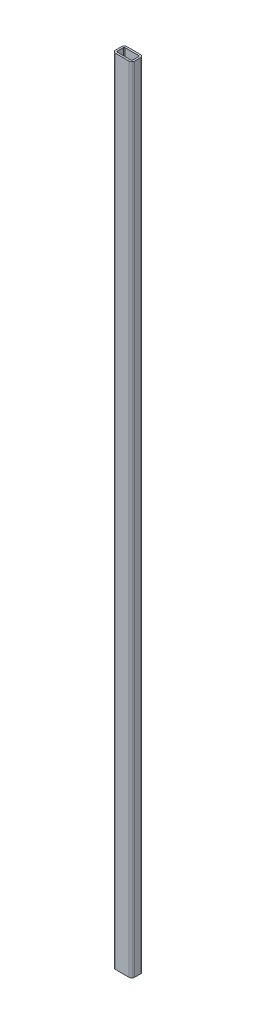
ISO-10303-21;
HEADER;
FILE_DESCRIPTION(('STEP AP214'),'2;1');
FILE_NAME('part.step','',(''),(''),'','','');
FILE_SCHEMA(('AUTOMOTIVE_DESIGN { 1 0 10303 214 1 1 1 1 }'));
ENDSEC;
DATA;
#1=APPLICATION_CONTEXT('core data for automotive mechanical design processes');
#2=APPLICATION_PROTOCOL_DEFINITION('international standard','automotive_design',2000,#1);
#3=PRODUCT_CONTEXT('',#1,'mechanical');
#4=PRODUCT('Part','Part','',(#3));
#5=PRODUCT_RELATED_PRODUCT_CATEGORY('part','',(#4));
#6=PRODUCT_DEFINITION_FORMATION('','',#4);
#7=PRODUCT_DEFINITION_CONTEXT('part definition',#1,'design');
#8=PRODUCT_DEFINITION('design','',#6,#7);
#9=PRODUCT_DEFINITION_SHAPE('','',#8);
#10=(LENGTH_UNIT() NAMED_UNIT(*) SI_UNIT(.MILLI.,.METRE.));
#11=(NAMED_UNIT(*) PLANE_ANGLE_UNIT() SI_UNIT($,.RADIAN.));
#12=(NAMED_UNIT(*) SI_UNIT($,.STERADIAN.) SOLID_ANGLE_UNIT());
#13=UNCERTAINTY_MEASURE_WITH_UNIT(LENGTH_MEASURE(1.E-05),#10,'distance_accuracy_value','');
#14=(GEOMETRIC_REPRESENTATION_CONTEXT(3) GLOBAL_UNCERTAINTY_ASSIGNED_CONTEXT((#13)) GLOBAL_UNIT_ASSIGNED_CONTEXT((#10,
#11,#12)) REPRESENTATION_CONTEXT('',''));
#15=CARTESIAN_POINT('',(0.,0.,0.));
#16=DIRECTION('',(0.,0.,1.));
#17=DIRECTION('',(1.,0.,0.));
#18=AXIS2_PLACEMENT_3D('',#15,#16,#17);
#19=CARTESIAN_POINT('',(0.,1320.8,0.));
#20=DIRECTION('',(0.,-1.,0.));
#21=DIRECTION('',(0.,0.,-1.));
#22=AXIS2_PLACEMENT_3D('',#19,#20,#21);
#23=PLANE('',#22);
#24=DIRECTION('',(-1.,0.,0.));
#25=VECTOR('',#24,1.);
#26=CARTESIAN_POINT('',(-15.875,1320.8,-9.525));
#27=LINE('',#26,#25);
#28=CARTESIAN_POINT('',(11.303,1320.8,-9.525));
#29=VERTEX_POINT('',#28);
#30=CARTESIAN_POINT('',(-11.303,1320.8,-9.525));
#31=VERTEX_POINT('',#30);
#32=EDGE_CURVE('E236',#29,#31,#27,.T.);
#33=ORIENTED_EDGE('',*,*,#32,.T.);
#34=CARTESIAN_POINT('',(-11.303,1320.8,-4.953));
#35=DIRECTION('',(0.,-1.,0.));
#36=DIRECTION('',(0.,0.,-1.));
#37=AXIS2_PLACEMENT_3D('',#34,#35,#36);
#38=CIRCLE('',#37,4.572);
#39=CARTESIAN_POINT('',(-15.875,1320.8,-4.953));
#40=VERTEX_POINT('',#39);
#41=EDGE_CURVE('E291',#31,#40,#38,.F.);
#42=ORIENTED_EDGE('',*,*,#41,.T.);
#43=DIRECTION('',(0.,0.,1.));
#44=VECTOR('',#43,1.);
#45=CARTESIAN_POINT('',(-15.875,1320.8,9.525));
#46=LINE('',#45,#44);
#47=CARTESIAN_POINT('',(-15.875,1320.8,4.953));
#48=VERTEX_POINT('',#47);
#49=EDGE_CURVE('E241',#40,#48,#46,.T.);
#50=ORIENTED_EDGE('',*,*,#49,.T.);
#51=CARTESIAN_POINT('',(-11.303,1320.8,4.953));
#52=DIRECTION('',(0.,-1.,0.));
#53=DIRECTION('',(0.,0.,-1.));
#54=AXIS2_PLACEMENT_3D('',#51,#52,#53);
#55=CIRCLE('',#54,4.572);
#56=CARTESIAN_POINT('',(-11.303,1320.8,9.525));
#57=VERTEX_POINT('',#56);
#58=EDGE_CURVE('E282',#48,#57,#55,.F.);
#59=ORIENTED_EDGE('',*,*,#58,.T.);
#60=DIRECTION('',(1.,0.,0.));
#61=VECTOR('',#60,1.);
#62=CARTESIAN_POINT('',(-15.875,1320.8,9.525));
#63=LINE('',#62,#61);
#64=CARTESIAN_POINT('',(11.303,1320.8,9.525));
#65=VERTEX_POINT('',#64);
#66=EDGE_CURVE('E245',#57,#65,#63,.T.);
#67=ORIENTED_EDGE('',*,*,#66,.T.);
#68=CARTESIAN_POINT('',(11.303,1320.8,4.953));
#69=DIRECTION('',(0.,-1.,0.));
#70=DIRECTION('',(0.,0.,-1.));
#71=AXIS2_PLACEMENT_3D('',#68,#69,#70);
#72=CIRCLE('',#71,4.572);
#73=CARTESIAN_POINT('',(15.875,1320.8,4.953));
#74=VERTEX_POINT('',#73);
#75=EDGE_CURVE('E285',#65,#74,#72,.F.);
#76=ORIENTED_EDGE('',*,*,#75,.T.);
#77=DIRECTION('',(0.,0.,-1.));
#78=VECTOR('',#77,1.);
#79=CARTESIAN_POINT('',(15.875,1320.8,9.525));
#80=LINE('',#79,#78);
#81=CARTESIAN_POINT('',(15.875,1320.8,-4.953));
#82=VERTEX_POINT('',#81);
#83=EDGE_CURVE('E232',#74,#82,#80,.T.);
#84=ORIENTED_EDGE('',*,*,#83,.T.);
#85=CARTESIAN_POINT('',(11.303,1320.8,-4.953));
#86=DIRECTION('',(0.,-1.,0.));
#87=DIRECTION('',(0.,0.,-1.));
#88=AXIS2_PLACEMENT_3D('',#85,#86,#87);
#89=CIRCLE('',#88,4.572);
#90=EDGE_CURVE('E288',#82,#29,#89,.F.);
#91=ORIENTED_EDGE('',*,*,#90,.T.);
#92=EDGE_LOOP('',(#33,#42,#50,#59,#67,#76,#84,#91));
#93=FACE_BOUND('',#92,.T.);
#94=DIRECTION('',(-1.,0.,0.));
#95=VECTOR('',#94,1.);
#96=CARTESIAN_POINT('',(0.,1320.8,-6.477));
#97=LINE('',#96,#95);
#98=CARTESIAN_POINT('',(11.303,1320.8,-6.477));
#99=VERTEX_POINT('',#98);
#100=CARTESIAN_POINT('',(-11.303,1320.8,-6.477));
#101=VERTEX_POINT('',#100);
#102=EDGE_CURVE('E208',#99,#101,#97,.T.);
#103=ORIENTED_EDGE('',*,*,#102,.F.);
#104=CARTESIAN_POINT('',(11.303,1320.8,-4.953));
#105=DIRECTION('',(0.,-1.,0.));
#106=DIRECTION('',(0.,0.,-1.));
#107=AXIS2_PLACEMENT_3D('',#104,#105,#106);
#108=CIRCLE('',#107,1.524);
#109=CARTESIAN_POINT('',(12.827,1320.8,-4.953));
#110=VERTEX_POINT('',#109);
#111=EDGE_CURVE('E209',#110,#99,#108,.F.);
#112=ORIENTED_EDGE('',*,*,#111,.F.);
#113=DIRECTION('',(0.,0.,-1.));
#114=VECTOR('',#113,1.);
#115=CARTESIAN_POINT('',(12.827,1320.8,0.));
#116=LINE('',#115,#114);
#117=CARTESIAN_POINT('',(12.827,1320.8,4.953));
#118=VERTEX_POINT('',#117);
#119=EDGE_CURVE('E57',#118,#110,#116,.T.);
#120=ORIENTED_EDGE('',*,*,#119,.F.);
#121=CARTESIAN_POINT('',(11.303,1320.8,4.953));
#122=DIRECTION('',(0.,-1.,0.));
#123=DIRECTION('',(0.,0.,-1.));
#124=AXIS2_PLACEMENT_3D('',#121,#122,#123);
#125=CIRCLE('',#124,1.524);
#126=CARTESIAN_POINT('',(11.303,1320.8,6.477));
#127=VERTEX_POINT('',#126);
#128=EDGE_CURVE('E174',#127,#118,#125,.F.);
#129=ORIENTED_EDGE('',*,*,#128,.F.);
#130=DIRECTION('',(1.,0.,0.));
#131=VECTOR('',#130,1.);
#132=CARTESIAN_POINT('',(0.,1320.8,6.477));
#133=LINE('',#132,#131);
#134=CARTESIAN_POINT('',(-11.303,1320.8,6.477));
#135=VERTEX_POINT('',#134);
#136=EDGE_CURVE('E221',#135,#127,#133,.T.);
#137=ORIENTED_EDGE('',*,*,#136,.F.);
#138=CARTESIAN_POINT('',(-11.303,1320.8,4.953));
#139=DIRECTION('',(0.,-1.,0.));
#140=DIRECTION('',(0.,0.,-1.));
#141=AXIS2_PLACEMENT_3D('',#138,#139,#140);
#142=CIRCLE('',#141,1.524);
#143=CARTESIAN_POINT('',(-12.827,1320.8,4.953));
#144=VERTEX_POINT('',#143);
#145=EDGE_CURVE('E222',#144,#135,#142,.F.);
#146=ORIENTED_EDGE('',*,*,#145,.F.);
#147=DIRECTION('',(0.,0.,1.));
#148=VECTOR('',#147,1.);
#149=CARTESIAN_POINT('',(-12.827,1320.8,0.));
#150=LINE('',#149,#148);
#151=CARTESIAN_POINT('',(-12.827,1320.8,-4.953));
#152=VERTEX_POINT('',#151);
#153=EDGE_CURVE('E215',#152,#144,#150,.T.);
#154=ORIENTED_EDGE('',*,*,#153,.F.);
#155=CARTESIAN_POINT('',(-11.303,1320.8,-4.953));
#156=DIRECTION('',(0.,-1.,0.));
#157=DIRECTION('',(0.,0.,-1.));
#158=AXIS2_PLACEMENT_3D('',#155,#156,#157);
#159=CIRCLE('',#158,1.524);
#160=EDGE_CURVE('E177',#101,#152,#159,.F.);
#161=ORIENTED_EDGE('',*,*,#160,.F.);
#162=EDGE_LOOP('',(#103,#112,#120,#129,#137,#146,#154,#161));
#163=FACE_BOUND('',#162,.T.);
#164=ADVANCED_FACE('F38',(#93,#163),#23,.F.);
#165=CARTESIAN_POINT('',(0.,0.,0.));
#166=DIRECTION('',(0.,-1.,0.));
#167=DIRECTION('',(0.,0.,-1.));
#168=AXIS2_PLACEMENT_3D('',#165,#166,#167);
#169=PLANE('',#168);
#170=DIRECTION('',(0.,0.,1.));
#171=VECTOR('',#170,1.);
#172=CARTESIAN_POINT('',(-15.875,0.,9.525));
#173=LINE('',#172,#171);
#174=CARTESIAN_POINT('',(-15.875,0.,-4.953));
#175=VERTEX_POINT('',#174);
#176=CARTESIAN_POINT('',(-15.875,0.,4.953));
#177=VERTEX_POINT('',#176);
#178=EDGE_CURVE('E256',#175,#177,#173,.T.);
#179=ORIENTED_EDGE('',*,*,#178,.F.);
#180=CARTESIAN_POINT('',(-11.303,0.,-4.953));
#181=DIRECTION('',(0.,-1.,0.));
#182=DIRECTION('',(0.,0.,-1.));
#183=AXIS2_PLACEMENT_3D('',#180,#181,#182);
#184=CIRCLE('',#183,4.572);
#185=CARTESIAN_POINT('',(-11.303,0.,-9.525));
#186=VERTEX_POINT('',#185);
#187=EDGE_CURVE('E273',#175,#186,#184,.T.);
#188=ORIENTED_EDGE('',*,*,#187,.T.);
#189=DIRECTION('',(-1.,0.,0.));
#190=VECTOR('',#189,1.);
#191=CARTESIAN_POINT('',(-15.875,0.,-9.525));
#192=LINE('',#191,#190);
#193=CARTESIAN_POINT('',(11.303,0.,-9.525));
#194=VERTEX_POINT('',#193);
#195=EDGE_CURVE('E252',#194,#186,#192,.T.);
#196=ORIENTED_EDGE('',*,*,#195,.F.);
#197=CARTESIAN_POINT('',(11.303,0.,-4.953));
#198=DIRECTION('',(0.,-1.,0.));
#199=DIRECTION('',(0.,0.,-1.));
#200=AXIS2_PLACEMENT_3D('',#197,#198,#199);
#201=CIRCLE('',#200,4.572);
#202=CARTESIAN_POINT('',(15.875,0.,-4.953));
#203=VERTEX_POINT('',#202);
#204=EDGE_CURVE('E271',#194,#203,#201,.T.);
#205=ORIENTED_EDGE('',*,*,#204,.T.);
#206=DIRECTION('',(0.,0.,-1.));
#207=VECTOR('',#206,1.);
#208=CARTESIAN_POINT('',(15.875,0.,9.525));
#209=LINE('',#208,#207);
#210=CARTESIAN_POINT('',(15.875,0.,4.953));
#211=VERTEX_POINT('',#210);
#212=EDGE_CURVE('E249',#211,#203,#209,.T.);
#213=ORIENTED_EDGE('',*,*,#212,.F.);
#214=CARTESIAN_POINT('',(11.303,0.,4.953));
#215=DIRECTION('',(0.,-1.,0.));
#216=DIRECTION('',(0.,0.,-1.));
#217=AXIS2_PLACEMENT_3D('',#214,#215,#216);
#218=CIRCLE('',#217,4.572);
#219=CARTESIAN_POINT('',(11.303,0.,9.525));
#220=VERTEX_POINT('',#219);
#221=EDGE_CURVE('E269',#211,#220,#218,.T.);
#222=ORIENTED_EDGE('',*,*,#221,.T.);
#223=DIRECTION('',(1.,0.,0.));
#224=VECTOR('',#223,1.);
#225=CARTESIAN_POINT('',(-15.875,0.,9.525));
#226=LINE('',#225,#224);
#227=CARTESIAN_POINT('',(-11.303,0.,9.525));
#228=VERTEX_POINT('',#227);
#229=EDGE_CURVE('E237',#228,#220,#226,.T.);
#230=ORIENTED_EDGE('',*,*,#229,.F.);
#231=CARTESIAN_POINT('',(-11.303,0.,4.953));
#232=DIRECTION('',(0.,-1.,0.));
#233=DIRECTION('',(0.,0.,-1.));
#234=AXIS2_PLACEMENT_3D('',#231,#232,#233);
#235=CIRCLE('',#234,4.572);
#236=EDGE_CURVE('E267',#228,#177,#235,.T.);
#237=ORIENTED_EDGE('',*,*,#236,.T.);
#238=EDGE_LOOP('',(#179,#188,#196,#205,#213,#222,#230,#237));
#239=FACE_BOUND('',#238,.T.);
#240=CARTESIAN_POINT('',(-11.303,0.,-4.953));
#241=DIRECTION('',(0.,-1.,0.));
#242=DIRECTION('',(0.,0.,-1.));
#243=AXIS2_PLACEMENT_3D('',#240,#241,#242);
#244=CIRCLE('',#243,1.524);
#245=CARTESIAN_POINT('',(-12.827,0.,-4.953));
#246=VERTEX_POINT('',#245);
#247=CARTESIAN_POINT('',(-11.303,0.,-6.477));
#248=VERTEX_POINT('',#247);
#249=EDGE_CURVE('E192',#246,#248,#244,.T.);
#250=ORIENTED_EDGE('',*,*,#249,.F.);
#251=DIRECTION('',(0.,0.,1.));
#252=VECTOR('',#251,1.);
#253=CARTESIAN_POINT('',(-12.827,0.,0.));
#254=LINE('',#253,#252);
#255=CARTESIAN_POINT('',(-12.827,0.,4.953));
#256=VERTEX_POINT('',#255);
#257=EDGE_CURVE('E198',#246,#256,#254,.T.);
#258=ORIENTED_EDGE('',*,*,#257,.T.);
#259=CARTESIAN_POINT('',(-11.303,0.,4.953));
#260=DIRECTION('',(0.,-1.,0.));
#261=DIRECTION('',(0.,0.,-1.));
#262=AXIS2_PLACEMENT_3D('',#259,#260,#261);
#263=CIRCLE('',#262,1.524);
#264=CARTESIAN_POINT('',(-11.303,0.,6.477));
#265=VERTEX_POINT('',#264);
#266=EDGE_CURVE('E190',#265,#256,#263,.T.);
#267=ORIENTED_EDGE('',*,*,#266,.F.);
#268=DIRECTION('',(1.,0.,0.));
#269=VECTOR('',#268,1.);
#270=CARTESIAN_POINT('',(0.,0.,6.477));
#271=LINE('',#270,#269);
#272=CARTESIAN_POINT('',(11.303,0.,6.477));
#273=VERTEX_POINT('',#272);
#274=EDGE_CURVE('E65',#265,#273,#271,.T.);
#275=ORIENTED_EDGE('',*,*,#274,.T.);
#276=CARTESIAN_POINT('',(11.303,0.,4.953));
#277=DIRECTION('',(0.,-1.,0.));
#278=DIRECTION('',(0.,0.,-1.));
#279=AXIS2_PLACEMENT_3D('',#276,#277,#278);
#280=CIRCLE('',#279,1.524);
#281=CARTESIAN_POINT('',(12.827,0.,4.953));
#282=VERTEX_POINT('',#281);
#283=EDGE_CURVE('E172',#282,#273,#280,.T.);
#284=ORIENTED_EDGE('',*,*,#283,.F.);
#285=DIRECTION('',(0.,0.,-1.));
#286=VECTOR('',#285,1.);
#287=CARTESIAN_POINT('',(12.827,0.,0.));
#288=LINE('',#287,#286);
#289=CARTESIAN_POINT('',(12.827,0.,-4.953));
#290=VERTEX_POINT('',#289);
#291=EDGE_CURVE('E180',#282,#290,#288,.T.);
#292=ORIENTED_EDGE('',*,*,#291,.T.);
#293=CARTESIAN_POINT('',(11.303,0.,-4.953));
#294=DIRECTION('',(0.,-1.,0.));
#295=DIRECTION('',(0.,0.,-1.));
#296=AXIS2_PLACEMENT_3D('',#293,#294,#295);
#297=CIRCLE('',#296,1.524);
#298=CARTESIAN_POINT('',(11.303,0.,-6.477));
#299=VERTEX_POINT('',#298);
#300=EDGE_CURVE('E189',#299,#290,#297,.T.);
#301=ORIENTED_EDGE('',*,*,#300,.F.);
#302=DIRECTION('',(-1.,0.,0.));
#303=VECTOR('',#302,1.);
#304=CARTESIAN_POINT('',(0.,0.,-6.477));
#305=LINE('',#304,#303);
#306=EDGE_CURVE('E184',#299,#248,#305,.T.);
#307=ORIENTED_EDGE('',*,*,#306,.T.);
#308=EDGE_LOOP('',(#250,#258,#267,#275,#284,#292,#301,#307));
#309=FACE_BOUND('',#308,.T.);
#310=ADVANCED_FACE('F187',(#239,#309),#169,.T.);
#311=CARTESIAN_POINT('',(15.875,1320.8,9.525));
#312=DIRECTION('',(-1.,0.,0.));
#313=DIRECTION('',(0.,0.,1.));
#314=AXIS2_PLACEMENT_3D('',#311,#312,#313);
#315=PLANE('',#314);
#316=ORIENTED_EDGE('',*,*,#212,.T.);
#317=DIRECTION('',(0.,-1.,0.));
#318=VECTOR('',#317,1.);
#319=CARTESIAN_POINT('',(15.875,1320.8,-4.953));
#320=LINE('',#319,#318);
#321=EDGE_CURVE('E298',#203,#82,#320,.F.);
#322=ORIENTED_EDGE('',*,*,#321,.T.);
#323=ORIENTED_EDGE('',*,*,#83,.F.);
#324=DIRECTION('',(0.,-1.,0.));
#325=VECTOR('',#324,1.);
#326=CARTESIAN_POINT('',(15.875,1320.8,4.953));
#327=LINE('',#326,#325);
#328=EDGE_CURVE('E294',#74,#211,#327,.T.);
#329=ORIENTED_EDGE('',*,*,#328,.T.);
#330=EDGE_LOOP('',(#316,#322,#323,#329));
#331=FACE_BOUND('',#330,.T.);
#332=ADVANCED_FACE('F319',(#331),#315,.F.);
#333=CARTESIAN_POINT('',(-15.875,1320.8,-9.525));
#334=DIRECTION('',(0.,0.,1.));
#335=DIRECTION('',(1.,0.,0.));
#336=AXIS2_PLACEMENT_3D('',#333,#334,#335);
#337=PLANE('',#336);
#338=ORIENTED_EDGE('',*,*,#195,.T.);
#339=DIRECTION('',(0.,-1.,0.));
#340=VECTOR('',#339,1.);
#341=CARTESIAN_POINT('',(-11.303,1320.8,-9.525));
#342=LINE('',#341,#340);
#343=EDGE_CURVE('E279',#186,#31,#342,.F.);
#344=ORIENTED_EDGE('',*,*,#343,.T.);
#345=ORIENTED_EDGE('',*,*,#32,.F.);
#346=DIRECTION('',(0.,-1.,0.));
#347=VECTOR('',#346,1.);
#348=CARTESIAN_POINT('',(11.303,1320.8,-9.525));
#349=LINE('',#348,#347);
#350=EDGE_CURVE('E275',#29,#194,#349,.T.);
#351=ORIENTED_EDGE('',*,*,#350,.T.);
#352=EDGE_LOOP('',(#338,#344,#345,#351));
#353=FACE_BOUND('',#352,.T.);
#354=ADVANCED_FACE('F330',(#353),#337,.F.);
#355=CARTESIAN_POINT('',(-15.875,1320.8,9.525));
#356=DIRECTION('',(1.,0.,0.));
#357=DIRECTION('',(0.,0.,-1.));
#358=AXIS2_PLACEMENT_3D('',#355,#356,#357);
#359=PLANE('',#358);
#360=ORIENTED_EDGE('',*,*,#49,.F.);
#361=DIRECTION('',(0.,-1.,0.));
#362=VECTOR('',#361,1.);
#363=CARTESIAN_POINT('',(-15.875,1320.8,-4.953));
#364=LINE('',#363,#362);
#365=EDGE_CURVE('E263',#40,#175,#364,.T.);
#366=ORIENTED_EDGE('',*,*,#365,.T.);
#367=ORIENTED_EDGE('',*,*,#178,.T.);
#368=DIRECTION('',(0.,-1.,0.));
#369=VECTOR('',#368,1.);
#370=CARTESIAN_POINT('',(-15.875,1320.8,4.953));
#371=LINE('',#370,#369);
#372=EDGE_CURVE('E248',#177,#48,#371,.F.);
#373=ORIENTED_EDGE('',*,*,#372,.T.);
#374=EDGE_LOOP('',(#360,#366,#367,#373));
#375=FACE_BOUND('',#374,.T.);
#376=ADVANCED_FACE('F338',(#375),#359,.F.);
#377=CARTESIAN_POINT('',(-15.875,1320.8,9.525));
#378=DIRECTION('',(0.,0.,-1.));
#379=DIRECTION('',(-1.,0.,0.));
#380=AXIS2_PLACEMENT_3D('',#377,#378,#379);
#381=PLANE('',#380);
#382=ORIENTED_EDGE('',*,*,#229,.T.);
#383=DIRECTION('',(0.,-1.,0.));
#384=VECTOR('',#383,1.);
#385=CARTESIAN_POINT('',(11.303,1320.8,9.525));
#386=LINE('',#385,#384);
#387=EDGE_CURVE('E11',#220,#65,#386,.F.);
#388=ORIENTED_EDGE('',*,*,#387,.T.);
#389=ORIENTED_EDGE('',*,*,#66,.F.);
#390=DIRECTION('',(0.,-1.,0.));
#391=VECTOR('',#390,1.);
#392=CARTESIAN_POINT('',(-11.303,1320.8,9.525));
#393=LINE('',#392,#391);
#394=EDGE_CURVE('E47',#57,#228,#393,.T.);
#395=ORIENTED_EDGE('',*,*,#394,.T.);
#396=EDGE_LOOP('',(#382,#388,#389,#395));
#397=FACE_BOUND('',#396,.T.);
#398=ADVANCED_FACE('F306',(#397),#381,.F.);
#399=CARTESIAN_POINT('',(-11.303,1320.8,-4.953));
#400=DIRECTION('',(0.,-1.,0.));
#401=DIRECTION('',(0.,0.,-1.));
#402=AXIS2_PLACEMENT_3D('',#399,#400,#401);
#403=CYLINDRICAL_SURFACE('',#402,4.572);
#404=ORIENTED_EDGE('',*,*,#41,.F.);
#405=ORIENTED_EDGE('',*,*,#343,.F.);
#406=ORIENTED_EDGE('',*,*,#187,.F.);
#407=ORIENTED_EDGE('',*,*,#365,.F.);
#408=EDGE_LOOP('',(#404,#405,#406,#407));
#409=FACE_BOUND('',#408,.T.);
#410=ADVANCED_FACE('F335',(#409),#403,.T.);
#411=CARTESIAN_POINT('',(11.303,1320.8,-4.953));
#412=DIRECTION('',(0.,-1.,0.));
#413=DIRECTION('',(0.,0.,-1.));
#414=AXIS2_PLACEMENT_3D('',#411,#412,#413);
#415=CYLINDRICAL_SURFACE('',#414,4.572);
#416=ORIENTED_EDGE('',*,*,#90,.F.);
#417=ORIENTED_EDGE('',*,*,#321,.F.);
#418=ORIENTED_EDGE('',*,*,#204,.F.);
#419=ORIENTED_EDGE('',*,*,#350,.F.);
#420=EDGE_LOOP('',(#416,#417,#418,#419));
#421=FACE_BOUND('',#420,.T.);
#422=ADVANCED_FACE('F327',(#421),#415,.T.);
#423=CARTESIAN_POINT('',(11.303,1320.8,4.953));
#424=DIRECTION('',(0.,-1.,0.));
#425=DIRECTION('',(0.,0.,-1.));
#426=AXIS2_PLACEMENT_3D('',#423,#424,#425);
#427=CYLINDRICAL_SURFACE('',#426,4.572);
#428=ORIENTED_EDGE('',*,*,#75,.F.);
#429=ORIENTED_EDGE('',*,*,#387,.F.);
#430=ORIENTED_EDGE('',*,*,#221,.F.);
#431=ORIENTED_EDGE('',*,*,#328,.F.);
#432=EDGE_LOOP('',(#428,#429,#430,#431));
#433=FACE_BOUND('',#432,.T.);
#434=ADVANCED_FACE('F316',(#433),#427,.T.);
#435=CARTESIAN_POINT('',(-11.303,1320.8,4.953));
#436=DIRECTION('',(0.,-1.,0.));
#437=DIRECTION('',(0.,0.,-1.));
#438=AXIS2_PLACEMENT_3D('',#435,#436,#437);
#439=CYLINDRICAL_SURFACE('',#438,4.572);
#440=ORIENTED_EDGE('',*,*,#58,.F.);
#441=ORIENTED_EDGE('',*,*,#372,.F.);
#442=ORIENTED_EDGE('',*,*,#236,.F.);
#443=ORIENTED_EDGE('',*,*,#394,.F.);
#444=EDGE_LOOP('',(#440,#441,#442,#443));
#445=FACE_BOUND('',#444,.T.);
#446=ADVANCED_FACE('F40',(#445),#439,.T.);
#447=CARTESIAN_POINT('',(12.827,1320.8,9.525));
#448=DIRECTION('',(-1.,0.,0.));
#449=DIRECTION('',(0.,0.,1.));
#450=AXIS2_PLACEMENT_3D('',#447,#448,#449);
#451=PLANE('',#450);
#452=ORIENTED_EDGE('',*,*,#291,.F.);
#453=DIRECTION('',(0.,1.,0.));
#454=VECTOR('',#453,1.);
#455=CARTESIAN_POINT('',(12.827,1320.8,4.953));
#456=LINE('',#455,#454);
#457=EDGE_CURVE('E168',#118,#282,#456,.F.);
#458=ORIENTED_EDGE('',*,*,#457,.F.);
#459=ORIENTED_EDGE('',*,*,#119,.T.);
#460=DIRECTION('',(0.,1.,0.));
#461=VECTOR('',#460,1.);
#462=CARTESIAN_POINT('',(12.827,1320.8,-4.953));
#463=LINE('',#462,#461);
#464=EDGE_CURVE('E176',#290,#110,#463,.T.);
#465=ORIENTED_EDGE('',*,*,#464,.F.);
#466=EDGE_LOOP('',(#452,#458,#459,#465));
#467=FACE_BOUND('',#466,.T.);
#468=ADVANCED_FACE('F181',(#467),#451,.T.);
#469=CARTESIAN_POINT('',(-15.875,1320.8,-6.477));
#470=DIRECTION('',(0.,0.,1.));
#471=DIRECTION('',(1.,0.,0.));
#472=AXIS2_PLACEMENT_3D('',#469,#470,#471);
#473=PLANE('',#472);
#474=ORIENTED_EDGE('',*,*,#306,.F.);
#475=DIRECTION('',(0.,1.,0.));
#476=VECTOR('',#475,1.);
#477=CARTESIAN_POINT('',(11.303,1320.8,-6.477));
#478=LINE('',#477,#476);
#479=EDGE_CURVE('E203',#99,#299,#478,.F.);
#480=ORIENTED_EDGE('',*,*,#479,.F.);
#481=ORIENTED_EDGE('',*,*,#102,.T.);
#482=DIRECTION('',(0.,1.,0.));
#483=VECTOR('',#482,1.);
#484=CARTESIAN_POINT('',(-11.303,1320.8,-6.477));
#485=LINE('',#484,#483);
#486=EDGE_CURVE('E225',#248,#101,#485,.T.);
#487=ORIENTED_EDGE('',*,*,#486,.F.);
#488=EDGE_LOOP('',(#474,#480,#481,#487));
#489=FACE_BOUND('',#488,.T.);
#490=ADVANCED_FACE('F345',(#489),#473,.T.);
#491=CARTESIAN_POINT('',(-12.827,1320.8,9.525));
#492=DIRECTION('',(1.,0.,0.));
#493=DIRECTION('',(0.,0.,-1.));
#494=AXIS2_PLACEMENT_3D('',#491,#492,#493);
#495=PLANE('',#494);
#496=ORIENTED_EDGE('',*,*,#153,.T.);
#497=DIRECTION('',(0.,1.,0.));
#498=VECTOR('',#497,1.);
#499=CARTESIAN_POINT('',(-12.827,1320.8,4.953));
#500=LINE('',#499,#498);
#501=EDGE_CURVE('E229',#256,#144,#500,.T.);
#502=ORIENTED_EDGE('',*,*,#501,.F.);
#503=ORIENTED_EDGE('',*,*,#257,.F.);
#504=DIRECTION('',(0.,1.,0.));
#505=VECTOR('',#504,1.);
#506=CARTESIAN_POINT('',(-12.827,1320.8,-4.953));
#507=LINE('',#506,#505);
#508=EDGE_CURVE('E194',#152,#246,#507,.F.);
#509=ORIENTED_EDGE('',*,*,#508,.F.);
#510=EDGE_LOOP('',(#496,#502,#503,#509));
#511=FACE_BOUND('',#510,.T.);
#512=ADVANCED_FACE('F405',(#511),#495,.T.);
#513=CARTESIAN_POINT('',(-15.875,1320.8,6.477));
#514=DIRECTION('',(0.,0.,-1.));
#515=DIRECTION('',(-1.,0.,0.));
#516=AXIS2_PLACEMENT_3D('',#513,#514,#515);
#517=PLANE('',#516);
#518=ORIENTED_EDGE('',*,*,#274,.F.);
#519=DIRECTION('',(0.,1.,0.));
#520=VECTOR('',#519,1.);
#521=CARTESIAN_POINT('',(-11.303,1320.8,6.477));
#522=LINE('',#521,#520);
#523=EDGE_CURVE('E464',#135,#265,#522,.F.);
#524=ORIENTED_EDGE('',*,*,#523,.F.);
#525=ORIENTED_EDGE('',*,*,#136,.T.);
#526=DIRECTION('',(0.,1.,0.));
#527=VECTOR('',#526,1.);
#528=CARTESIAN_POINT('',(11.303,1320.8,6.477));
#529=LINE('',#528,#527);
#530=EDGE_CURVE('E253',#273,#127,#529,.T.);
#531=ORIENTED_EDGE('',*,*,#530,.F.);
#532=EDGE_LOOP('',(#518,#524,#525,#531));
#533=FACE_BOUND('',#532,.T.);
#534=ADVANCED_FACE('F415',(#533),#517,.T.);
#535=CARTESIAN_POINT('',(-11.303,1320.8,-4.953));
#536=DIRECTION('',(0.,-1.,0.));
#537=DIRECTION('',(0.,0.,-1.));
#538=AXIS2_PLACEMENT_3D('',#535,#536,#537);
#539=CYLINDRICAL_SURFACE('',#538,1.524);
#540=ORIENTED_EDGE('',*,*,#160,.T.);
#541=ORIENTED_EDGE('',*,*,#508,.T.);
#542=ORIENTED_EDGE('',*,*,#249,.T.);
#543=ORIENTED_EDGE('',*,*,#486,.T.);
#544=EDGE_LOOP('',(#540,#541,#542,#543));
#545=FACE_BOUND('',#544,.T.);
#546=ADVANCED_FACE('F425',(#545),#539,.F.);
#547=CARTESIAN_POINT('',(11.303,1320.8,-4.953));
#548=DIRECTION('',(0.,-1.,0.));
#549=DIRECTION('',(0.,0.,-1.));
#550=AXIS2_PLACEMENT_3D('',#547,#548,#549);
#551=CYLINDRICAL_SURFACE('',#550,1.524);
#552=ORIENTED_EDGE('',*,*,#111,.T.);
#553=ORIENTED_EDGE('',*,*,#479,.T.);
#554=ORIENTED_EDGE('',*,*,#300,.T.);
#555=ORIENTED_EDGE('',*,*,#464,.T.);
#556=EDGE_LOOP('',(#552,#553,#554,#555));
#557=FACE_BOUND('',#556,.T.);
#558=ADVANCED_FACE('F434',(#557),#551,.F.);
#559=CARTESIAN_POINT('',(11.303,1320.8,4.953));
#560=DIRECTION('',(0.,-1.,0.));
#561=DIRECTION('',(0.,0.,-1.));
#562=AXIS2_PLACEMENT_3D('',#559,#560,#561);
#563=CYLINDRICAL_SURFACE('',#562,1.524);
#564=ORIENTED_EDGE('',*,*,#128,.T.);
#565=ORIENTED_EDGE('',*,*,#457,.T.);
#566=ORIENTED_EDGE('',*,*,#283,.T.);
#567=ORIENTED_EDGE('',*,*,#530,.T.);
#568=EDGE_LOOP('',(#564,#565,#566,#567));
#569=FACE_BOUND('',#568,.T.);
#570=ADVANCED_FACE('F170',(#569),#563,.F.);
#571=CARTESIAN_POINT('',(-11.303,1320.8,4.953));
#572=DIRECTION('',(0.,-1.,0.));
#573=DIRECTION('',(0.,0.,-1.));
#574=AXIS2_PLACEMENT_3D('',#571,#572,#573);
#575=CYLINDRICAL_SURFACE('',#574,1.524);
#576=ORIENTED_EDGE('',*,*,#145,.T.);
#577=ORIENTED_EDGE('',*,*,#523,.T.);
#578=ORIENTED_EDGE('',*,*,#266,.T.);
#579=ORIENTED_EDGE('',*,*,#501,.T.);
#580=EDGE_LOOP('',(#576,#577,#578,#579));
#581=FACE_BOUND('',#580,.T.);
#582=ADVANCED_FACE('F354',(#581),#575,.F.);
#583=CLOSED_SHELL('',(#164,#310,#332,#354,#376,#398,#410,#422,#434,#446,#468,#490,#512,#534,
#546,#558,#570,#582));
#584=MANIFOLD_SOLID_BREP('B2',#583);
#585=ADVANCED_BREP_SHAPE_REPRESENTATION('',(#18,#584),#14);
#586=SHAPE_DEFINITION_REPRESENTATION(#9,#585);
ENDSEC;
END-ISO-10303-21;
